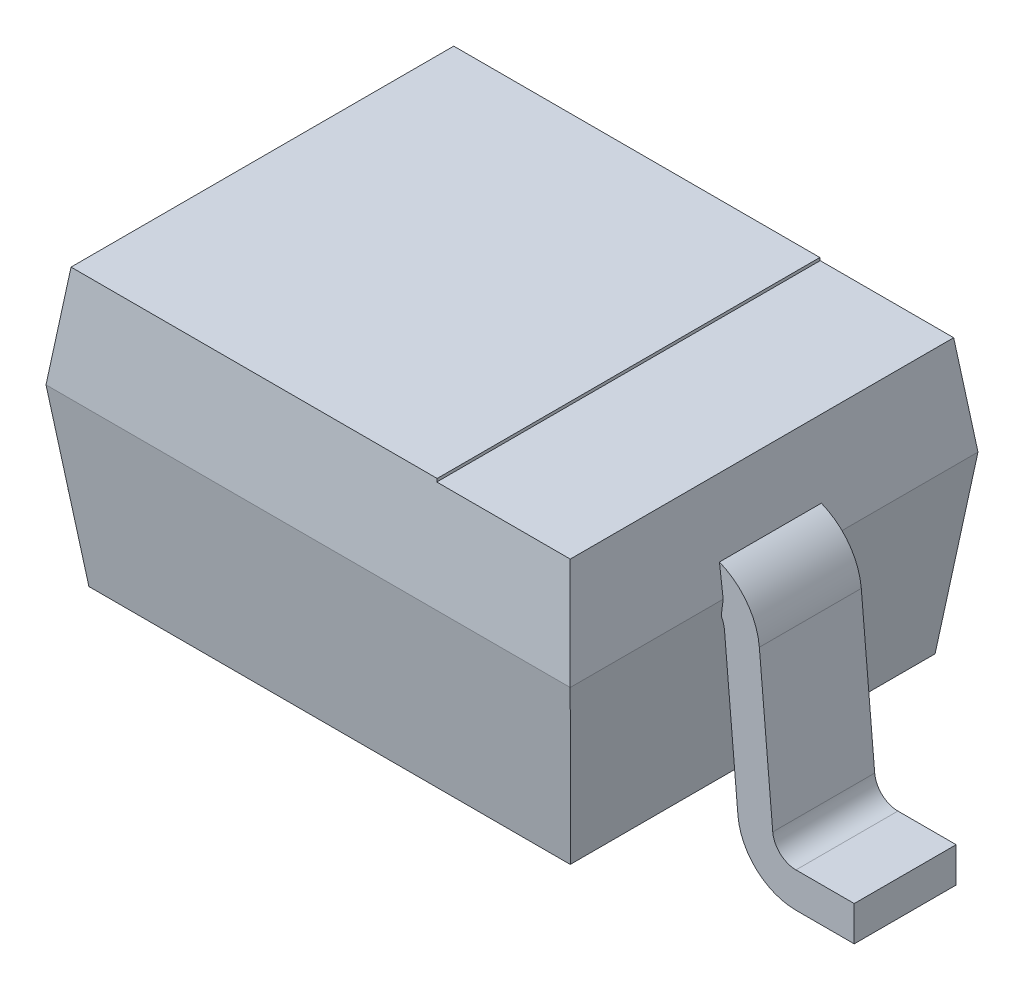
ISO-10303-21;
HEADER;
FILE_DESCRIPTION(('STEP AP214'),'2;1');
FILE_NAME('part.step','',(''),(''),'','','');
FILE_SCHEMA(('AUTOMOTIVE_DESIGN { 1 0 10303 214 1 1 1 1 }'));
ENDSEC;
DATA;
#1=APPLICATION_CONTEXT('core data for automotive mechanical design processes');
#2=APPLICATION_PROTOCOL_DEFINITION('international standard','automotive_design',2000,#1);
#3=PRODUCT_CONTEXT('',#1,'mechanical');
#4=PRODUCT('Part','Part','',(#3));
#5=PRODUCT_RELATED_PRODUCT_CATEGORY('part','',(#4));
#6=PRODUCT_DEFINITION_FORMATION('','',#4);
#7=PRODUCT_DEFINITION_CONTEXT('part definition',#1,'design');
#8=PRODUCT_DEFINITION('design','',#6,#7);
#9=PRODUCT_DEFINITION_SHAPE('','',#8);
#10=(LENGTH_UNIT() NAMED_UNIT(*) SI_UNIT(.MILLI.,.METRE.));
#11=(NAMED_UNIT(*) PLANE_ANGLE_UNIT() SI_UNIT($,.RADIAN.));
#12=(NAMED_UNIT(*) SI_UNIT($,.STERADIAN.) SOLID_ANGLE_UNIT());
#13=UNCERTAINTY_MEASURE_WITH_UNIT(LENGTH_MEASURE(1.E-05),#10,'distance_accuracy_value','');
#14=(GEOMETRIC_REPRESENTATION_CONTEXT(3) GLOBAL_UNCERTAINTY_ASSIGNED_CONTEXT((#13)) GLOBAL_UNIT_ASSIGNED_CONTEXT((#10,
#11,#12)) REPRESENTATION_CONTEXT('',''));
#15=CARTESIAN_POINT('',(0.,0.,0.));
#16=DIRECTION('',(0.,0.,1.));
#17=DIRECTION('',(1.,0.,0.));
#18=AXIS2_PLACEMENT_3D('',#15,#16,#17);
#19=CARTESIAN_POINT('',(0.9,0.8,0.7));
#20=DIRECTION('',(0.992546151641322,-0.121869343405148,0.));
#21=DIRECTION('',(0.121869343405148,0.992546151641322,0.));
#22=AXIS2_PLACEMENT_3D('',#19,#20,#21);
#23=PLANE('',#22);
#24=DIRECTION('',(-0.121869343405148,-0.992546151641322,0.));
#25=VECTOR('',#24,1.);
#26=CARTESIAN_POINT('',(0.9,0.8,0.175));
#27=LINE('',#26,#25);
#28=CARTESIAN_POINT('',(0.9,0.8,0.175));
#29=VERTEX_POINT('',#28);
#30=CARTESIAN_POINT('',(0.893470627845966,0.746822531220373,0.175));
#31=VERTEX_POINT('',#30);
#32=EDGE_CURVE('E416',#29,#31,#27,.T.);
#33=ORIENTED_EDGE('',*,*,#32,.F.);
#34=DIRECTION('',(0.,0.,-1.));
#35=VECTOR('',#34,1.);
#36=CARTESIAN_POINT('',(0.9,0.8,0.7));
#37=LINE('',#36,#35);
#38=CARTESIAN_POINT('',(0.9,0.8,0.7));
#39=VERTEX_POINT('',#38);
#40=EDGE_CURVE('E253',#39,#29,#37,.T.);
#41=ORIENTED_EDGE('',*,*,#40,.F.);
#42=DIRECTION('',(0.120974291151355,0.985256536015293,0.120974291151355));
#43=VECTOR('',#42,1.);
#44=CARTESIAN_POINT('',(0.873657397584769,0.58545672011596,0.673657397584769));
#45=LINE('',#44,#43);
#46=CARTESIAN_POINT('',(0.826329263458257,0.2,0.626329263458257));
#47=VERTEX_POINT('',#46);
#48=EDGE_CURVE('E267',#47,#39,#45,.T.);
#49=ORIENTED_EDGE('',*,*,#48,.F.);
#50=DIRECTION('',(0.,0.,-1.));
#51=VECTOR('',#50,1.);
#52=CARTESIAN_POINT('',(0.826329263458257,0.2,0.7));
#53=LINE('',#52,#51);
#54=CARTESIAN_POINT('',(0.826329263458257,0.2,-0.626329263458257));
#55=VERTEX_POINT('',#54);
#56=EDGE_CURVE('E266',#47,#55,#53,.T.);
#57=ORIENTED_EDGE('',*,*,#56,.T.);
#58=DIRECTION('',(0.120974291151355,0.985256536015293,-0.120974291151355));
#59=VECTOR('',#58,1.);
#60=CARTESIAN_POINT('',(0.879511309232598,0.633133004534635,-0.679511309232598));
#61=LINE('',#60,#59);
#62=CARTESIAN_POINT('',(0.9,0.8,-0.7));
#63=VERTEX_POINT('',#62);
#64=EDGE_CURVE('E272',#55,#63,#61,.T.);
#65=ORIENTED_EDGE('',*,*,#64,.T.);
#66=CARTESIAN_POINT('',(0.9,0.8,-0.175));
#67=VERTEX_POINT('',#66);
#68=EDGE_CURVE('E257',#67,#63,#37,.T.);
#69=ORIENTED_EDGE('',*,*,#68,.F.);
#70=DIRECTION('',(-0.121869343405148,-0.992546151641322,0.));
#71=VECTOR('',#70,1.);
#72=CARTESIAN_POINT('',(0.9,0.8,-0.175));
#73=LINE('',#72,#71);
#74=CARTESIAN_POINT('',(0.893470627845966,0.746822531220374,-0.175));
#75=VERTEX_POINT('',#74);
#76=EDGE_CURVE('E411',#67,#75,#73,.T.);
#77=ORIENTED_EDGE('',*,*,#76,.T.);
#78=DIRECTION('',(0.,0.,-1.));
#79=VECTOR('',#78,1.);
#80=CARTESIAN_POINT('',(0.893470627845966,0.746822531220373,0.175));
#81=LINE('',#80,#79);
#82=EDGE_CURVE('E54',#75,#31,#81,.F.);
#83=ORIENTED_EDGE('',*,*,#82,.T.);
#84=EDGE_LOOP('',(#33,#41,#49,#57,#65,#69,#77,#83));
#85=FACE_BOUND('',#84,.T.);
#86=ADVANCED_FACE('F31',(#85),#23,.T.);
#87=CARTESIAN_POINT('',(-0.9,0.8,0.7));
#88=DIRECTION('',(0.,-0.121869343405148,0.992546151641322));
#89=DIRECTION('',(0.,-0.992546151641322,-0.121869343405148));
#90=AXIS2_PLACEMENT_3D('',#87,#88,#89);
#91=PLANE('',#90);
#92=DIRECTION('',(1.,0.,0.));
#93=VECTOR('',#92,1.);
#94=CARTESIAN_POINT('',(-0.9,0.8,0.7));
#95=LINE('',#94,#93);
#96=CARTESIAN_POINT('',(-0.9,0.8,0.7));
#97=VERTEX_POINT('',#96);
#98=EDGE_CURVE('E263',#97,#39,#95,.T.);
#99=ORIENTED_EDGE('',*,*,#98,.F.);
#100=DIRECTION('',(-0.120974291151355,0.985256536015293,0.120974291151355));
#101=VECTOR('',#100,1.);
#102=CARTESIAN_POINT('',(-0.9,0.8,0.7));
#103=LINE('',#102,#101);
#104=CARTESIAN_POINT('',(-0.826329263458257,0.2,0.626329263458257));
#105=VERTEX_POINT('',#104);
#106=EDGE_CURVE('E271',#105,#97,#103,.T.);
#107=ORIENTED_EDGE('',*,*,#106,.F.);
#108=DIRECTION('',(1.,0.,0.));
#109=VECTOR('',#108,1.);
#110=CARTESIAN_POINT('',(-0.9,0.2,0.626329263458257));
#111=LINE('',#110,#109);
#112=EDGE_CURVE('E276',#105,#47,#111,.T.);
#113=ORIENTED_EDGE('',*,*,#112,.T.);
#114=ORIENTED_EDGE('',*,*,#48,.T.);
#115=EDGE_LOOP('',(#99,#107,#113,#114));
#116=FACE_BOUND('',#115,.T.);
#117=ADVANCED_FACE('F33',(#116),#91,.T.);
#118=CARTESIAN_POINT('',(-0.9,0.8,0.7));
#119=DIRECTION('',(-0.992546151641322,-0.121869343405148,0.));
#120=DIRECTION('',(0.121869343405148,-0.992546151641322,0.));
#121=AXIS2_PLACEMENT_3D('',#118,#119,#120);
#122=PLANE('',#121);
#123=DIRECTION('',(-0.121869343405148,0.992546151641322,0.));
#124=VECTOR('',#123,1.);
#125=CARTESIAN_POINT('',(-0.9,0.8,0.175));
#126=LINE('',#125,#124);
#127=CARTESIAN_POINT('',(-0.893470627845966,0.746822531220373,0.175));
#128=VERTEX_POINT('',#127);
#129=CARTESIAN_POINT('',(-0.9,0.8,0.175));
#130=VERTEX_POINT('',#129);
#131=EDGE_CURVE('E311',#128,#130,#126,.T.);
#132=ORIENTED_EDGE('',*,*,#131,.F.);
#133=DIRECTION('',(0.,0.,-1.));
#134=VECTOR('',#133,1.);
#135=CARTESIAN_POINT('',(-0.893470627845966,0.746822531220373,0.175));
#136=LINE('',#135,#134);
#137=CARTESIAN_POINT('',(-0.893470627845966,0.746822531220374,-0.175));
#138=VERTEX_POINT('',#137);
#139=EDGE_CURVE('E300',#128,#138,#136,.T.);
#140=ORIENTED_EDGE('',*,*,#139,.T.);
#141=DIRECTION('',(-0.121869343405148,0.992546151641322,0.));
#142=VECTOR('',#141,1.);
#143=CARTESIAN_POINT('',(-0.9,0.8,-0.175));
#144=LINE('',#143,#142);
#145=CARTESIAN_POINT('',(-0.9,0.8,-0.175));
#146=VERTEX_POINT('',#145);
#147=EDGE_CURVE('E308',#138,#146,#144,.T.);
#148=ORIENTED_EDGE('',*,*,#147,.T.);
#149=DIRECTION('',(0.,0.,1.));
#150=VECTOR('',#149,1.);
#151=CARTESIAN_POINT('',(-0.9,0.8,0.7));
#152=LINE('',#151,#150);
#153=CARTESIAN_POINT('',(-0.9,0.8,-0.7));
#154=VERTEX_POINT('',#153);
#155=EDGE_CURVE('E261',#154,#146,#152,.T.);
#156=ORIENTED_EDGE('',*,*,#155,.F.);
#157=DIRECTION('',(-0.120974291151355,0.985256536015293,-0.120974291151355));
#158=VECTOR('',#157,1.);
#159=CARTESIAN_POINT('',(-0.9,0.8,-0.7));
#160=LINE('',#159,#158);
#161=CARTESIAN_POINT('',(-0.826329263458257,0.2,-0.626329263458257));
#162=VERTEX_POINT('',#161);
#163=EDGE_CURVE('E275',#162,#154,#160,.T.);
#164=ORIENTED_EDGE('',*,*,#163,.F.);
#165=DIRECTION('',(0.,0.,1.));
#166=VECTOR('',#165,1.);
#167=CARTESIAN_POINT('',(-0.826329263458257,0.2,0.7));
#168=LINE('',#167,#166);
#169=EDGE_CURVE('E285',#162,#105,#168,.T.);
#170=ORIENTED_EDGE('',*,*,#169,.T.);
#171=ORIENTED_EDGE('',*,*,#106,.T.);
#172=EDGE_CURVE('E260',#130,#97,#152,.T.);
#173=ORIENTED_EDGE('',*,*,#172,.F.);
#174=EDGE_LOOP('',(#132,#140,#148,#156,#164,#170,#171,#173));
#175=FACE_BOUND('',#174,.T.);
#176=ADVANCED_FACE('F306',(#175),#122,.T.);
#177=CARTESIAN_POINT('',(-0.9,0.8,-0.7));
#178=DIRECTION('',(0.,-0.121869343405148,-0.992546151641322));
#179=DIRECTION('',(0.,0.992546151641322,-0.121869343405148));
#180=AXIS2_PLACEMENT_3D('',#177,#178,#179);
#181=PLANE('',#180);
#182=DIRECTION('',(-1.,0.,0.));
#183=VECTOR('',#182,1.);
#184=CARTESIAN_POINT('',(-0.9,0.8,-0.7));
#185=LINE('',#184,#183);
#186=EDGE_CURVE('E256',#63,#154,#185,.T.);
#187=ORIENTED_EDGE('',*,*,#186,.F.);
#188=ORIENTED_EDGE('',*,*,#64,.F.);
#189=DIRECTION('',(-1.,0.,0.));
#190=VECTOR('',#189,1.);
#191=CARTESIAN_POINT('',(-0.9,0.2,-0.626329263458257));
#192=LINE('',#191,#190);
#193=EDGE_CURVE('E282',#55,#162,#192,.T.);
#194=ORIENTED_EDGE('',*,*,#193,.T.);
#195=ORIENTED_EDGE('',*,*,#163,.T.);
#196=EDGE_LOOP('',(#187,#188,#194,#195));
#197=FACE_BOUND('',#196,.T.);
#198=ADVANCED_FACE('F439',(#197),#181,.T.);
#199=CARTESIAN_POINT('',(0.9,0.2,-0.7));
#200=DIRECTION('',(0.,-1.,0.));
#201=DIRECTION('',(0.,0.,-1.));
#202=AXIS2_PLACEMENT_3D('',#199,#200,#201);
#203=PLANE('',#202);
#204=ORIENTED_EDGE('',*,*,#56,.F.);
#205=ORIENTED_EDGE('',*,*,#112,.F.);
#206=ORIENTED_EDGE('',*,*,#169,.F.);
#207=ORIENTED_EDGE('',*,*,#193,.F.);
#208=EDGE_LOOP('',(#204,#205,#206,#207));
#209=FACE_BOUND('',#208,.T.);
#210=ADVANCED_FACE('F436',(#209),#203,.T.);
#211=CARTESIAN_POINT('',(0.9,0.8,0.7));
#212=DIRECTION('',(0.992546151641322,0.121869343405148,0.));
#213=DIRECTION('',(-0.121869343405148,0.992546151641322,0.));
#214=AXIS2_PLACEMENT_3D('',#211,#212,#213);
#215=PLANE('',#214);
#216=DIRECTION('',(0.120974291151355,-0.985256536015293,-0.120974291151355));
#217=VECTOR('',#216,1.);
#218=CARTESIAN_POINT('',(0.873657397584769,1.01454327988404,-0.673657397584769));
#219=LINE('',#218,#217);
#220=CARTESIAN_POINT('',(0.858253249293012,1.14,-0.658253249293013));
#221=VERTEX_POINT('',#220);
#222=EDGE_CURVE('E418',#221,#63,#219,.T.);
#223=ORIENTED_EDGE('',*,*,#222,.F.);
#224=DIRECTION('',(0.,0.,-1.));
#225=VECTOR('',#224,1.);
#226=CARTESIAN_POINT('',(0.858253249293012,1.14,0.7));
#227=LINE('',#226,#225);
#228=CARTESIAN_POINT('',(0.858253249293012,1.14,0.658253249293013));
#229=VERTEX_POINT('',#228);
#230=EDGE_CURVE('E516',#221,#229,#227,.F.);
#231=ORIENTED_EDGE('',*,*,#230,.T.);
#232=DIRECTION('',(0.120974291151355,-0.985256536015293,0.120974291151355));
#233=VECTOR('',#232,1.);
#234=CARTESIAN_POINT('',(0.9,0.8,0.7));
#235=LINE('',#234,#233);
#236=EDGE_CURVE('E245',#229,#39,#235,.T.);
#237=ORIENTED_EDGE('',*,*,#236,.T.);
#238=ORIENTED_EDGE('',*,*,#40,.T.);
#239=DIRECTION('',(0.121869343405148,-0.992546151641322,0.));
#240=VECTOR('',#239,1.);
#241=CARTESIAN_POINT('',(0.9,0.8,0.175));
#242=LINE('',#241,#240);
#243=CARTESIAN_POINT('',(0.887217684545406,0.904103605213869,0.175));
#244=VERTEX_POINT('',#243);
#245=EDGE_CURVE('E414',#29,#244,#242,.F.);
#246=ORIENTED_EDGE('',*,*,#245,.T.);
#247=DIRECTION('',(0.,0.,-1.));
#248=VECTOR('',#247,1.);
#249=CARTESIAN_POINT('',(0.887217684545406,0.904103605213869,0.175));
#250=LINE('',#249,#248);
#251=CARTESIAN_POINT('',(0.887217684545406,0.904103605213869,-0.175));
#252=VERTEX_POINT('',#251);
#253=EDGE_CURVE('E297',#252,#244,#250,.F.);
#254=ORIENTED_EDGE('',*,*,#253,.F.);
#255=DIRECTION('',(0.121869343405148,-0.992546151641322,0.));
#256=VECTOR('',#255,1.);
#257=CARTESIAN_POINT('',(0.9,0.8,-0.175));
#258=LINE('',#257,#256);
#259=EDGE_CURVE('E322',#67,#252,#258,.F.);
#260=ORIENTED_EDGE('',*,*,#259,.F.);
#261=ORIENTED_EDGE('',*,*,#68,.T.);
#262=EDGE_LOOP('',(#223,#231,#237,#238,#246,#254,#260,#261));
#263=FACE_BOUND('',#262,.T.);
#264=ADVANCED_FACE('F522',(#263),#215,.T.);
#265=CARTESIAN_POINT('',(-0.9,0.8,-0.7));
#266=DIRECTION('',(0.,0.121869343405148,-0.992546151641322));
#267=DIRECTION('',(0.,0.992546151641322,0.121869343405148));
#268=AXIS2_PLACEMENT_3D('',#265,#266,#267);
#269=PLANE('',#268);
#270=DIRECTION('',(1.,0.,0.));
#271=VECTOR('',#270,1.);
#272=CARTESIAN_POINT('',(0.9,1.15,-0.657025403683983));
#273=LINE('',#272,#271);
#274=CARTESIAN_POINT('',(0.4,1.15,-0.657025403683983));
#275=VERTEX_POINT('',#274);
#276=CARTESIAN_POINT('',(-0.857025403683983,1.15,-0.657025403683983));
#277=VERTEX_POINT('',#276);
#278=EDGE_CURVE('E249',#275,#277,#273,.F.);
#279=ORIENTED_EDGE('',*,*,#278,.F.);
#280=DIRECTION('',(0.,0.992546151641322,0.121869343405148));
#281=VECTOR('',#280,1.);
#282=CARTESIAN_POINT('',(0.4,0.8,-0.7));
#283=LINE('',#282,#281);
#284=CARTESIAN_POINT('',(0.4,1.14,-0.658253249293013));
#285=VERTEX_POINT('',#284);
#286=EDGE_CURVE('E46',#275,#285,#283,.F.);
#287=ORIENTED_EDGE('',*,*,#286,.T.);
#288=DIRECTION('',(-1.,0.,0.));
#289=VECTOR('',#288,1.);
#290=CARTESIAN_POINT('',(-0.9,1.14,-0.658253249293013));
#291=LINE('',#290,#289);
#292=EDGE_CURVE('E494',#285,#221,#291,.F.);
#293=ORIENTED_EDGE('',*,*,#292,.T.);
#294=ORIENTED_EDGE('',*,*,#222,.T.);
#295=ORIENTED_EDGE('',*,*,#186,.T.);
#296=DIRECTION('',(-0.120974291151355,-0.985256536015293,-0.120974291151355));
#297=VECTOR('',#296,1.);
#298=CARTESIAN_POINT('',(-0.879511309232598,0.966866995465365,-0.679511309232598));
#299=LINE('',#298,#297);
#300=EDGE_CURVE('E419',#277,#154,#299,.T.);
#301=ORIENTED_EDGE('',*,*,#300,.F.);
#302=EDGE_LOOP('',(#279,#287,#293,#294,#295,#301));
#303=FACE_BOUND('',#302,.T.);
#304=ADVANCED_FACE('F425',(#303),#269,.T.);
#305=CARTESIAN_POINT('',(-0.9,0.8,0.7));
#306=DIRECTION('',(-0.992546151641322,0.121869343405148,0.));
#307=DIRECTION('',(-0.121869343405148,-0.992546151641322,0.));
#308=AXIS2_PLACEMENT_3D('',#305,#306,#307);
#309=PLANE('',#308);
#310=DIRECTION('',(0.,0.,-1.));
#311=VECTOR('',#310,1.);
#312=CARTESIAN_POINT('',(-0.887217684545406,0.904103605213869,0.175));
#313=LINE('',#312,#311);
#314=CARTESIAN_POINT('',(-0.887217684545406,0.904103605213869,0.175));
#315=VERTEX_POINT('',#314);
#316=CARTESIAN_POINT('',(-0.887217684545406,0.904103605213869,-0.175));
#317=VERTEX_POINT('',#316);
#318=EDGE_CURVE('E292',#315,#317,#313,.T.);
#319=ORIENTED_EDGE('',*,*,#318,.F.);
#320=DIRECTION('',(0.121869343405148,0.992546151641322,0.));
#321=VECTOR('',#320,1.);
#322=CARTESIAN_POINT('',(-0.9,0.8,0.175));
#323=LINE('',#322,#321);
#324=EDGE_CURVE('E295',#315,#130,#323,.F.);
#325=ORIENTED_EDGE('',*,*,#324,.T.);
#326=ORIENTED_EDGE('',*,*,#172,.T.);
#327=DIRECTION('',(-0.120974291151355,-0.985256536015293,0.120974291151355));
#328=VECTOR('',#327,1.);
#329=CARTESIAN_POINT('',(-0.9,0.8,0.7));
#330=LINE('',#329,#328);
#331=CARTESIAN_POINT('',(-0.857025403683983,1.15,0.657025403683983));
#332=VERTEX_POINT('',#331);
#333=EDGE_CURVE('E247',#332,#97,#330,.T.);
#334=ORIENTED_EDGE('',*,*,#333,.F.);
#335=DIRECTION('',(0.,0.,-1.));
#336=VECTOR('',#335,1.);
#337=CARTESIAN_POINT('',(-0.857025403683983,1.15,-0.7));
#338=LINE('',#337,#336);
#339=EDGE_CURVE('E243',#277,#332,#338,.F.);
#340=ORIENTED_EDGE('',*,*,#339,.F.);
#341=ORIENTED_EDGE('',*,*,#300,.T.);
#342=ORIENTED_EDGE('',*,*,#155,.T.);
#343=DIRECTION('',(0.121869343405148,0.992546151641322,0.));
#344=VECTOR('',#343,1.);
#345=CARTESIAN_POINT('',(-0.9,0.8,-0.175));
#346=LINE('',#345,#344);
#347=EDGE_CURVE('E270',#317,#146,#346,.F.);
#348=ORIENTED_EDGE('',*,*,#347,.F.);
#349=EDGE_LOOP('',(#319,#325,#326,#334,#340,#341,#342,#348));
#350=FACE_BOUND('',#349,.T.);
#351=ADVANCED_FACE('F428',(#350),#309,.T.);
#352=CARTESIAN_POINT('',(-0.9,0.8,0.7));
#353=DIRECTION('',(0.,0.121869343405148,0.992546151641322));
#354=DIRECTION('',(0.,-0.992546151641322,0.121869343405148));
#355=AXIS2_PLACEMENT_3D('',#352,#353,#354);
#356=PLANE('',#355);
#357=DIRECTION('',(1.,0.,0.));
#358=VECTOR('',#357,1.);
#359=CARTESIAN_POINT('',(-0.9,1.14,0.658253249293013));
#360=LINE('',#359,#358);
#361=CARTESIAN_POINT('',(0.4,1.14,0.658253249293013));
#362=VERTEX_POINT('',#361);
#363=EDGE_CURVE('E11',#229,#362,#360,.F.);
#364=ORIENTED_EDGE('',*,*,#363,.T.);
#365=DIRECTION('',(0.,-0.992546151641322,0.121869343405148));
#366=VECTOR('',#365,1.);
#367=CARTESIAN_POINT('',(0.4,0.8,0.7));
#368=LINE('',#367,#366);
#369=CARTESIAN_POINT('',(0.4,1.15,0.657025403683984));
#370=VERTEX_POINT('',#369);
#371=EDGE_CURVE('E228',#362,#370,#368,.F.);
#372=ORIENTED_EDGE('',*,*,#371,.T.);
#373=DIRECTION('',(-1.,0.,0.));
#374=VECTOR('',#373,1.);
#375=CARTESIAN_POINT('',(0.9,1.15,0.657025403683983));
#376=LINE('',#375,#374);
#377=EDGE_CURVE('E237',#332,#370,#376,.F.);
#378=ORIENTED_EDGE('',*,*,#377,.F.);
#379=ORIENTED_EDGE('',*,*,#333,.T.);
#380=ORIENTED_EDGE('',*,*,#98,.T.);
#381=ORIENTED_EDGE('',*,*,#236,.F.);
#382=EDGE_LOOP('',(#364,#372,#378,#379,#380,#381));
#383=FACE_BOUND('',#382,.T.);
#384=ADVANCED_FACE('F235',(#383),#356,.T.);
#385=CARTESIAN_POINT('',(0.9,1.15,-0.7));
#386=DIRECTION('',(0.,-1.,0.));
#387=DIRECTION('',(0.,0.,-1.));
#388=AXIS2_PLACEMENT_3D('',#385,#386,#387);
#389=PLANE('',#388);
#390=ORIENTED_EDGE('',*,*,#377,.T.);
#391=DIRECTION('',(0.,0.,-1.));
#392=VECTOR('',#391,1.);
#393=CARTESIAN_POINT('',(0.4,1.15,-0.7));
#394=LINE('',#393,#392);
#395=EDGE_CURVE('E39',#370,#275,#394,.T.);
#396=ORIENTED_EDGE('',*,*,#395,.T.);
#397=ORIENTED_EDGE('',*,*,#278,.T.);
#398=ORIENTED_EDGE('',*,*,#339,.T.);
#399=EDGE_LOOP('',(#390,#396,#397,#398));
#400=FACE_BOUND('',#399,.T.);
#401=ADVANCED_FACE('F241',(#400),#389,.F.);
#402=CARTESIAN_POINT('',(-1.07030442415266,0.193027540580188,0.175));
#403=DIRECTION('',(0.996194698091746,-0.0871557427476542,0.));
#404=DIRECTION('',(0.0871557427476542,0.996194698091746,0.));
#405=AXIS2_PLACEMENT_3D('',#402,#403,#404);
#406=PLANE('',#405);
#407=DIRECTION('',(-0.0871557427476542,-0.996194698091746,0.));
#408=VECTOR('',#407,1.);
#409=CARTESIAN_POINT('',(-1.07030442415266,0.193027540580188,-0.175));
#410=LINE('',#409,#408);
#411=CARTESIAN_POINT('',(-1.02427255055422,0.719174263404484,-0.175));
#412=VERTEX_POINT('',#411);
#413=CARTESIAN_POINT('',(-1.07030442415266,0.193027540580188,-0.175));
#414=VERTEX_POINT('',#413);
#415=EDGE_CURVE('E356',#412,#414,#410,.T.);
#416=ORIENTED_EDGE('',*,*,#415,.T.);
#417=DIRECTION('',(0.,0.,-1.));
#418=VECTOR('',#417,1.);
#419=CARTESIAN_POINT('',(-1.07030442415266,0.193027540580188,0.175));
#420=LINE('',#419,#418);
#421=CARTESIAN_POINT('',(-1.07030442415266,0.193027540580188,0.175));
#422=VERTEX_POINT('',#421);
#423=EDGE_CURVE('E370',#422,#414,#420,.T.);
#424=ORIENTED_EDGE('',*,*,#423,.F.);
#425=DIRECTION('',(-0.0871557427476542,-0.996194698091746,0.));
#426=VECTOR('',#425,1.);
#427=CARTESIAN_POINT('',(-1.07030442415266,0.193027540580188,0.175));
#428=LINE('',#427,#426);
#429=CARTESIAN_POINT('',(-1.02427255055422,0.719174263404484,0.175));
#430=VERTEX_POINT('',#429);
#431=EDGE_CURVE('E485',#430,#422,#428,.T.);
#432=ORIENTED_EDGE('',*,*,#431,.F.);
#433=DIRECTION('',(0.,0.,-1.));
#434=VECTOR('',#433,1.);
#435=CARTESIAN_POINT('',(-1.02427255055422,0.719174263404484,0.175));
#436=LINE('',#435,#434);
#437=EDGE_CURVE('E373',#430,#412,#436,.T.);
#438=ORIENTED_EDGE('',*,*,#437,.T.);
#439=EDGE_LOOP('',(#416,#424,#432,#438));
#440=FACE_BOUND('',#439,.T.);
#441=ADVANCED_FACE('F618',(#440),#406,.F.);
#442=CARTESIAN_POINT('',(-1.15,0.2,0.175));
#443=DIRECTION('',(0.,0.,-1.));
#444=DIRECTION('',(-1.,0.,0.));
#445=AXIS2_PLACEMENT_3D('',#442,#443,#444);
#446=CYLINDRICAL_SURFACE('',#445,0.08);
#447=CARTESIAN_POINT('',(-1.15,0.2,-0.175));
#448=DIRECTION('',(0.,0.,-1.));
#449=DIRECTION('',(1.,0.,0.));
#450=AXIS2_PLACEMENT_3D('',#447,#448,#449);
#451=CIRCLE('',#450,0.08);
#452=CARTESIAN_POINT('',(-1.15,0.12,-0.175));
#453=VERTEX_POINT('',#452);
#454=EDGE_CURVE('E358',#414,#453,#451,.T.);
#455=ORIENTED_EDGE('',*,*,#454,.T.);
#456=DIRECTION('',(0.,0.,-1.));
#457=VECTOR('',#456,1.);
#458=CARTESIAN_POINT('',(-1.15,0.12,0.175));
#459=LINE('',#458,#457);
#460=CARTESIAN_POINT('',(-1.15,0.12,0.175));
#461=VERTEX_POINT('',#460);
#462=EDGE_CURVE('E366',#461,#453,#459,.T.);
#463=ORIENTED_EDGE('',*,*,#462,.F.);
#464=CARTESIAN_POINT('',(-1.15,0.2,0.175));
#465=DIRECTION('',(0.,0.,-1.));
#466=DIRECTION('',(1.,0.,0.));
#467=AXIS2_PLACEMENT_3D('',#464,#465,#466);
#468=CIRCLE('',#467,0.08);
#469=EDGE_CURVE('E487',#422,#461,#468,.T.);
#470=ORIENTED_EDGE('',*,*,#469,.F.);
#471=ORIENTED_EDGE('',*,*,#423,.T.);
#472=EDGE_LOOP('',(#455,#463,#470,#471));
#473=FACE_BOUND('',#472,.T.);
#474=ADVANCED_FACE('F625',(#473),#446,.F.);
#475=CARTESIAN_POINT('',(-1.35,0.12,0.175));
#476=DIRECTION('',(0.,-1.,0.));
#477=DIRECTION('',(0.,0.,-1.));
#478=AXIS2_PLACEMENT_3D('',#475,#476,#477);
#479=PLANE('',#478);
#480=DIRECTION('',(-1.,0.,0.));
#481=VECTOR('',#480,1.);
#482=CARTESIAN_POINT('',(-1.35,0.12,-0.175));
#483=LINE('',#482,#481);
#484=CARTESIAN_POINT('',(-1.35,0.12,-0.175));
#485=VERTEX_POINT('',#484);
#486=EDGE_CURVE('E360',#453,#485,#483,.T.);
#487=ORIENTED_EDGE('',*,*,#486,.T.);
#488=DIRECTION('',(0.,0.,-1.));
#489=VECTOR('',#488,1.);
#490=CARTESIAN_POINT('',(-1.35,0.12,0.175));
#491=LINE('',#490,#489);
#492=CARTESIAN_POINT('',(-1.35,0.12,0.175));
#493=VERTEX_POINT('',#492);
#494=EDGE_CURVE('E363',#493,#485,#491,.T.);
#495=ORIENTED_EDGE('',*,*,#494,.F.);
#496=DIRECTION('',(-1.,0.,0.));
#497=VECTOR('',#496,1.);
#498=CARTESIAN_POINT('',(-1.35,0.12,0.175));
#499=LINE('',#498,#497);
#500=EDGE_CURVE('E367',#461,#493,#499,.T.);
#501=ORIENTED_EDGE('',*,*,#500,.F.);
#502=ORIENTED_EDGE('',*,*,#462,.T.);
#503=EDGE_LOOP('',(#487,#495,#501,#502));
#504=FACE_BOUND('',#503,.T.);
#505=ADVANCED_FACE('F633',(#504),#479,.F.);
#506=CARTESIAN_POINT('',(-1.35,0.,0.175));
#507=DIRECTION('',(1.,0.,0.));
#508=DIRECTION('',(0.,0.,-1.));
#509=AXIS2_PLACEMENT_3D('',#506,#507,#508);
#510=PLANE('',#509);
#511=DIRECTION('',(0.,-1.,0.));
#512=VECTOR('',#511,1.);
#513=CARTESIAN_POINT('',(-1.35,0.,-0.175));
#514=LINE('',#513,#512);
#515=CARTESIAN_POINT('',(-1.35,0.,-0.175));
#516=VERTEX_POINT('',#515);
#517=EDGE_CURVE('E490',#485,#516,#514,.T.);
#518=ORIENTED_EDGE('',*,*,#517,.T.);
#519=DIRECTION('',(0.,0.,-1.));
#520=VECTOR('',#519,1.);
#521=CARTESIAN_POINT('',(-1.35,0.,0.175));
#522=LINE('',#521,#520);
#523=CARTESIAN_POINT('',(-1.35,0.,0.175));
#524=VERTEX_POINT('',#523);
#525=EDGE_CURVE('E323',#524,#516,#522,.T.);
#526=ORIENTED_EDGE('',*,*,#525,.F.);
#527=DIRECTION('',(0.,-1.,0.));
#528=VECTOR('',#527,1.);
#529=CARTESIAN_POINT('',(-1.35,0.,0.175));
#530=LINE('',#529,#528);
#531=EDGE_CURVE('E362',#493,#524,#530,.T.);
#532=ORIENTED_EDGE('',*,*,#531,.F.);
#533=ORIENTED_EDGE('',*,*,#494,.T.);
#534=EDGE_LOOP('',(#518,#526,#532,#533));
#535=FACE_BOUND('',#534,.T.);
#536=ADVANCED_FACE('F641',(#535),#510,.F.);
#537=CARTESIAN_POINT('',(-1.35,0.,0.175));
#538=DIRECTION('',(0.,1.,0.));
#539=DIRECTION('',(0.,0.,1.));
#540=AXIS2_PLACEMENT_3D('',#537,#538,#539);
#541=PLANE('',#540);
#542=DIRECTION('',(1.,0.,0.));
#543=VECTOR('',#542,1.);
#544=CARTESIAN_POINT('',(-1.35,0.,-0.175));
#545=LINE('',#544,#543);
#546=CARTESIAN_POINT('',(-1.15,0.,-0.175));
#547=VERTEX_POINT('',#546);
#548=EDGE_CURVE('E493',#516,#547,#545,.T.);
#549=ORIENTED_EDGE('',*,*,#548,.T.);
#550=DIRECTION('',(0.,0.,-1.));
#551=VECTOR('',#550,1.);
#552=CARTESIAN_POINT('',(-1.15,0.,0.175));
#553=LINE('',#552,#551);
#554=CARTESIAN_POINT('',(-1.15,0.,0.175));
#555=VERTEX_POINT('',#554);
#556=EDGE_CURVE('E404',#555,#547,#553,.T.);
#557=ORIENTED_EDGE('',*,*,#556,.F.);
#558=DIRECTION('',(1.,0.,0.));
#559=VECTOR('',#558,1.);
#560=CARTESIAN_POINT('',(-1.35,0.,0.175));
#561=LINE('',#560,#559);
#562=EDGE_CURVE('E508',#524,#555,#561,.T.);
#563=ORIENTED_EDGE('',*,*,#562,.F.);
#564=ORIENTED_EDGE('',*,*,#525,.T.);
#565=EDGE_LOOP('',(#549,#557,#563,#564));
#566=FACE_BOUND('',#565,.T.);
#567=ADVANCED_FACE('F649',(#566),#541,.F.);
#568=CARTESIAN_POINT('',(-1.15,0.2,0.175));
#569=DIRECTION('',(0.,0.,-1.));
#570=DIRECTION('',(-1.,0.,0.));
#571=AXIS2_PLACEMENT_3D('',#568,#569,#570);
#572=CYLINDRICAL_SURFACE('',#571,0.2);
#573=CARTESIAN_POINT('',(-1.15,0.2,-0.175));
#574=DIRECTION('',(0.,0.,1.));
#575=DIRECTION('',(1.,0.,0.));
#576=AXIS2_PLACEMENT_3D('',#573,#574,#575);
#577=CIRCLE('',#576,0.2);
#578=CARTESIAN_POINT('',(-0.950761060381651,0.182568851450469,-0.175));
#579=VERTEX_POINT('',#578);
#580=EDGE_CURVE('E334',#547,#579,#577,.T.);
#581=ORIENTED_EDGE('',*,*,#580,.T.);
#582=DIRECTION('',(0.,0.,-1.));
#583=VECTOR('',#582,1.);
#584=CARTESIAN_POINT('',(-0.950761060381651,0.182568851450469,0.175));
#585=LINE('',#584,#583);
#586=CARTESIAN_POINT('',(-0.950761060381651,0.182568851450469,0.175));
#587=VERTEX_POINT('',#586);
#588=EDGE_CURVE('E401',#587,#579,#585,.T.);
#589=ORIENTED_EDGE('',*,*,#588,.F.);
#590=CARTESIAN_POINT('',(-1.15,0.2,0.175));
#591=DIRECTION('',(0.,0.,1.));
#592=DIRECTION('',(1.,0.,0.));
#593=AXIS2_PLACEMENT_3D('',#590,#591,#592);
#594=CIRCLE('',#593,0.2);
#595=EDGE_CURVE('E506',#555,#587,#594,.T.);
#596=ORIENTED_EDGE('',*,*,#595,.F.);
#597=ORIENTED_EDGE('',*,*,#556,.T.);
#598=EDGE_LOOP('',(#581,#589,#596,#597));
#599=FACE_BOUND('',#598,.T.);
#600=ADVANCED_FACE('F498',(#599),#572,.T.);
#601=CARTESIAN_POINT('',(-0.950761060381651,0.182568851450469,0.175));
#602=DIRECTION('',(-0.996194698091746,0.0871557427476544,0.));
#603=DIRECTION('',(-0.0871557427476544,-0.996194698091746,0.));
#604=AXIS2_PLACEMENT_3D('',#601,#602,#603);
#605=PLANE('',#604);
#606=DIRECTION('',(0.0871557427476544,0.996194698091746,0.));
#607=VECTOR('',#606,1.);
#608=CARTESIAN_POINT('',(-0.950761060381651,0.182568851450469,-0.175));
#609=LINE('',#608,#607);
#610=CARTESIAN_POINT('',(-0.90472918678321,0.708715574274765,-0.175));
#611=VERTEX_POINT('',#610);
#612=EDGE_CURVE('E330',#579,#611,#609,.T.);
#613=ORIENTED_EDGE('',*,*,#612,.T.);
#614=DIRECTION('',(0.,0.,-1.));
#615=VECTOR('',#614,1.);
#616=CARTESIAN_POINT('',(-0.90472918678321,0.708715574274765,0.175));
#617=LINE('',#616,#615);
#618=CARTESIAN_POINT('',(-0.90472918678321,0.708715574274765,0.175));
#619=VERTEX_POINT('',#618);
#620=EDGE_CURVE('E328',#619,#611,#617,.T.);
#621=ORIENTED_EDGE('',*,*,#620,.F.);
#622=DIRECTION('',(0.0871557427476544,0.996194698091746,0.));
#623=VECTOR('',#622,1.);
#624=CARTESIAN_POINT('',(-0.950761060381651,0.182568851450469,0.175));
#625=LINE('',#624,#623);
#626=EDGE_CURVE('E504',#587,#619,#625,.T.);
#627=ORIENTED_EDGE('',*,*,#626,.F.);
#628=ORIENTED_EDGE('',*,*,#588,.T.);
#629=EDGE_LOOP('',(#613,#621,#627,#628));
#630=FACE_BOUND('',#629,.T.);
#631=ADVANCED_FACE('F503',(#630),#605,.F.);
#632=CARTESIAN_POINT('',(-1.15,0.2,-0.175));
#633=DIRECTION('',(0.,0.,1.));
#634=DIRECTION('',(1.,0.,0.));
#635=AXIS2_PLACEMENT_3D('',#632,#633,#634);
#636=PLANE('',#635);
#637=ORIENTED_EDGE('',*,*,#147,.F.);
#638=CARTESIAN_POINT('',(-0.805109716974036,0.7,-0.175));
#639=DIRECTION('',(0.,0.,-1.));
#640=DIRECTION('',(-1.,0.,0.));
#641=AXIS2_PLACEMENT_3D('',#638,#639,#640);
#642=CIRCLE('',#641,0.0999999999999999);
#643=EDGE_CURVE('E320',#611,#138,#642,.T.);
#644=ORIENTED_EDGE('',*,*,#643,.F.);
#645=ORIENTED_EDGE('',*,*,#612,.F.);
#646=ORIENTED_EDGE('',*,*,#580,.F.);
#647=ORIENTED_EDGE('',*,*,#548,.F.);
#648=ORIENTED_EDGE('',*,*,#517,.F.);
#649=ORIENTED_EDGE('',*,*,#486,.F.);
#650=ORIENTED_EDGE('',*,*,#454,.F.);
#651=ORIENTED_EDGE('',*,*,#415,.F.);
#652=CARTESIAN_POINT('',(-0.805109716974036,0.7,-0.175));
#653=DIRECTION('',(0.,0.,1.));
#654=DIRECTION('',(-1.,0.,0.));
#655=AXIS2_PLACEMENT_3D('',#652,#653,#654);
#656=CIRCLE('',#655,0.22);
#657=EDGE_CURVE('E354',#317,#412,#656,.T.);
#658=ORIENTED_EDGE('',*,*,#657,.F.);
#659=ORIENTED_EDGE('',*,*,#347,.T.);
#660=EDGE_LOOP('',(#637,#644,#645,#646,#647,#648,#649,#650,#651,#658,#659));
#661=FACE_BOUND('',#660,.T.);
#662=ADVANCED_FACE('F318',(#661),#636,.F.);
#663=CARTESIAN_POINT('',(-1.15,0.2,0.175));
#664=DIRECTION('',(0.,0.,1.));
#665=DIRECTION('',(1.,0.,0.));
#666=AXIS2_PLACEMENT_3D('',#663,#664,#665);
#667=PLANE('',#666);
#668=CARTESIAN_POINT('',(-0.805109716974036,0.7,0.175));
#669=DIRECTION('',(0.,0.,-1.));
#670=DIRECTION('',(-1.,0.,0.));
#671=AXIS2_PLACEMENT_3D('',#668,#669,#670);
#672=CIRCLE('',#671,0.0999999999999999);
#673=EDGE_CURVE('E467',#619,#128,#672,.T.);
#674=ORIENTED_EDGE('',*,*,#673,.T.);
#675=ORIENTED_EDGE('',*,*,#131,.T.);
#676=ORIENTED_EDGE('',*,*,#324,.F.);
#677=CARTESIAN_POINT('',(-0.805109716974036,0.7,0.175));
#678=DIRECTION('',(0.,0.,1.));
#679=DIRECTION('',(-1.,0.,0.));
#680=AXIS2_PLACEMENT_3D('',#677,#678,#679);
#681=CIRCLE('',#680,0.22);
#682=EDGE_CURVE('E483',#315,#430,#681,.T.);
#683=ORIENTED_EDGE('',*,*,#682,.T.);
#684=ORIENTED_EDGE('',*,*,#431,.T.);
#685=ORIENTED_EDGE('',*,*,#469,.T.);
#686=ORIENTED_EDGE('',*,*,#500,.T.);
#687=ORIENTED_EDGE('',*,*,#531,.T.);
#688=ORIENTED_EDGE('',*,*,#562,.T.);
#689=ORIENTED_EDGE('',*,*,#595,.T.);
#690=ORIENTED_EDGE('',*,*,#626,.T.);
#691=EDGE_LOOP('',(#674,#675,#676,#683,#684,#685,#686,#687,#688,#689,#690));
#692=FACE_BOUND('',#691,.T.);
#693=ADVANCED_FACE('F676',(#692),#667,.T.);
#694=CARTESIAN_POINT('',(-0.805109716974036,0.7,0.175));
#695=DIRECTION('',(0.,0.,-1.));
#696=DIRECTION('',(-1.,0.,0.));
#697=AXIS2_PLACEMENT_3D('',#694,#695,#696);
#698=CYLINDRICAL_SURFACE('',#697,0.22);
#699=ORIENTED_EDGE('',*,*,#682,.F.);
#700=ORIENTED_EDGE('',*,*,#318,.T.);
#701=ORIENTED_EDGE('',*,*,#657,.T.);
#702=ORIENTED_EDGE('',*,*,#437,.F.);
#703=EDGE_LOOP('',(#699,#700,#701,#702));
#704=FACE_BOUND('',#703,.T.);
#705=ADVANCED_FACE('F683',(#704),#698,.T.);
#706=CARTESIAN_POINT('',(-0.805109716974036,0.7,0.175));
#707=DIRECTION('',(0.,0.,-1.));
#708=DIRECTION('',(-1.,0.,0.));
#709=AXIS2_PLACEMENT_3D('',#706,#707,#708);
#710=CYLINDRICAL_SURFACE('',#709,0.0999999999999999);
#711=ORIENTED_EDGE('',*,*,#139,.F.);
#712=ORIENTED_EDGE('',*,*,#673,.F.);
#713=ORIENTED_EDGE('',*,*,#620,.T.);
#714=ORIENTED_EDGE('',*,*,#643,.T.);
#715=EDGE_LOOP('',(#711,#712,#713,#714));
#716=FACE_BOUND('',#715,.T.);
#717=ADVANCED_FACE('F326',(#716),#710,.F.);
#718=CARTESIAN_POINT('',(0.805109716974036,0.7,0.175));
#719=DIRECTION('',(0.,0.,-1.));
#720=DIRECTION('',(-1.,0.,0.));
#721=AXIS2_PLACEMENT_3D('',#718,#719,#720);
#722=CYLINDRICAL_SURFACE('',#721,0.22);
#723=CARTESIAN_POINT('',(0.805109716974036,0.7,-0.175));
#724=DIRECTION('',(0.,0.,1.));
#725=DIRECTION('',(1.,0.,0.));
#726=AXIS2_PLACEMENT_3D('',#723,#724,#725);
#727=CIRCLE('',#726,0.22);
#728=CARTESIAN_POINT('',(1.02427255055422,0.719174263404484,-0.175));
#729=VERTEX_POINT('',#728);
#730=EDGE_CURVE('E351',#729,#252,#727,.T.);
#731=ORIENTED_EDGE('',*,*,#730,.T.);
#732=ORIENTED_EDGE('',*,*,#253,.T.);
#733=CARTESIAN_POINT('',(0.805109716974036,0.7,0.175));
#734=DIRECTION('',(0.,0.,1.));
#735=DIRECTION('',(1.,0.,0.));
#736=AXIS2_PLACEMENT_3D('',#733,#734,#735);
#737=CIRCLE('',#736,0.22);
#738=CARTESIAN_POINT('',(1.02427255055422,0.719174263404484,0.175));
#739=VERTEX_POINT('',#738);
#740=EDGE_CURVE('E480',#739,#244,#737,.T.);
#741=ORIENTED_EDGE('',*,*,#740,.F.);
#742=DIRECTION('',(0.,0.,-1.));
#743=VECTOR('',#742,1.);
#744=CARTESIAN_POINT('',(1.02427255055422,0.719174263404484,0.175));
#745=LINE('',#744,#743);
#746=EDGE_CURVE('E376',#739,#729,#745,.T.);
#747=ORIENTED_EDGE('',*,*,#746,.T.);
#748=EDGE_LOOP('',(#731,#732,#741,#747));
#749=FACE_BOUND('',#748,.T.);
#750=ADVANCED_FACE('F529',(#749),#722,.T.);
#751=ORIENTED_EDGE('',*,*,#245,.F.);
#752=ORIENTED_EDGE('',*,*,#32,.T.);
#753=CARTESIAN_POINT('',(0.805109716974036,0.7,0.175));
#754=DIRECTION('',(0.,0.,-1.));
#755=DIRECTION('',(1.,0.,0.));
#756=AXIS2_PLACEMENT_3D('',#753,#754,#755);
#757=CIRCLE('',#756,0.0999999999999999);
#758=CARTESIAN_POINT('',(0.90472918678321,0.708715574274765,0.175));
#759=VERTEX_POINT('',#758);
#760=EDGE_CURVE('E463',#31,#759,#757,.T.);
#761=ORIENTED_EDGE('',*,*,#760,.T.);
#762=DIRECTION('',(0.0871557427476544,-0.996194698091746,0.));
#763=VECTOR('',#762,1.);
#764=CARTESIAN_POINT('',(0.950761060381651,0.182568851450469,0.175));
#765=LINE('',#764,#763);
#766=CARTESIAN_POINT('',(0.950761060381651,0.182568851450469,0.175));
#767=VERTEX_POINT('',#766);
#768=EDGE_CURVE('E459',#759,#767,#765,.T.);
#769=ORIENTED_EDGE('',*,*,#768,.T.);
#770=CARTESIAN_POINT('',(1.15,0.2,0.175));
#771=DIRECTION('',(0.,0.,1.));
#772=DIRECTION('',(-1.,0.,0.));
#773=AXIS2_PLACEMENT_3D('',#770,#771,#772);
#774=CIRCLE('',#773,0.2);
#775=CARTESIAN_POINT('',(1.15,0.,0.175));
#776=VERTEX_POINT('',#775);
#777=EDGE_CURVE('E462',#767,#776,#774,.T.);
#778=ORIENTED_EDGE('',*,*,#777,.T.);
#779=DIRECTION('',(1.,0.,0.));
#780=VECTOR('',#779,1.);
#781=CARTESIAN_POINT('',(1.35,0.,0.175));
#782=LINE('',#781,#780);
#783=CARTESIAN_POINT('',(1.35,0.,0.175));
#784=VERTEX_POINT('',#783);
#785=EDGE_CURVE('E465',#776,#784,#782,.T.);
#786=ORIENTED_EDGE('',*,*,#785,.T.);
#787=DIRECTION('',(0.,1.,0.));
#788=VECTOR('',#787,1.);
#789=CARTESIAN_POINT('',(1.35,0.,0.175));
#790=LINE('',#789,#788);
#791=CARTESIAN_POINT('',(1.35,0.12,0.175));
#792=VERTEX_POINT('',#791);
#793=EDGE_CURVE('E472',#784,#792,#790,.T.);
#794=ORIENTED_EDGE('',*,*,#793,.T.);
#795=DIRECTION('',(-1.,0.,0.));
#796=VECTOR('',#795,1.);
#797=CARTESIAN_POINT('',(1.35,0.12,0.175));
#798=LINE('',#797,#796);
#799=CARTESIAN_POINT('',(1.15,0.12,0.175));
#800=VERTEX_POINT('',#799);
#801=EDGE_CURVE('E474',#792,#800,#798,.T.);
#802=ORIENTED_EDGE('',*,*,#801,.T.);
#803=CARTESIAN_POINT('',(1.15,0.2,0.175));
#804=DIRECTION('',(0.,0.,-1.));
#805=DIRECTION('',(-1.,0.,0.));
#806=AXIS2_PLACEMENT_3D('',#803,#804,#805);
#807=CIRCLE('',#806,0.08);
#808=CARTESIAN_POINT('',(1.07030442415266,0.193027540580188,0.175));
#809=VERTEX_POINT('',#808);
#810=EDGE_CURVE('E476',#800,#809,#807,.T.);
#811=ORIENTED_EDGE('',*,*,#810,.T.);
#812=DIRECTION('',(-0.0871557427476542,0.996194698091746,0.));
#813=VECTOR('',#812,1.);
#814=CARTESIAN_POINT('',(1.07030442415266,0.193027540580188,0.175));
#815=LINE('',#814,#813);
#816=EDGE_CURVE('E478',#809,#739,#815,.T.);
#817=ORIENTED_EDGE('',*,*,#816,.T.);
#818=ORIENTED_EDGE('',*,*,#740,.T.);
#819=EDGE_LOOP('',(#751,#752,#761,#769,#778,#786,#794,#802,#811,#817,#818));
#820=FACE_BOUND('',#819,.T.);
#821=ADVANCED_FACE('F524',(#820),#667,.T.);
#822=ORIENTED_EDGE('',*,*,#76,.F.);
#823=ORIENTED_EDGE('',*,*,#259,.T.);
#824=ORIENTED_EDGE('',*,*,#730,.F.);
#825=DIRECTION('',(-0.0871557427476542,0.996194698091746,0.));
#826=VECTOR('',#825,1.);
#827=CARTESIAN_POINT('',(1.07030442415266,0.193027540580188,-0.175));
#828=LINE('',#827,#826);
#829=CARTESIAN_POINT('',(1.07030442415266,0.193027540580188,-0.175));
#830=VERTEX_POINT('',#829);
#831=EDGE_CURVE('E349',#830,#729,#828,.T.);
#832=ORIENTED_EDGE('',*,*,#831,.F.);
#833=CARTESIAN_POINT('',(1.15,0.2,-0.175));
#834=DIRECTION('',(0.,0.,-1.));
#835=DIRECTION('',(-1.,0.,0.));
#836=AXIS2_PLACEMENT_3D('',#833,#834,#835);
#837=CIRCLE('',#836,0.08);
#838=CARTESIAN_POINT('',(1.15,0.12,-0.175));
#839=VERTEX_POINT('',#838);
#840=EDGE_CURVE('E347',#839,#830,#837,.T.);
#841=ORIENTED_EDGE('',*,*,#840,.F.);
#842=DIRECTION('',(-1.,0.,0.));
#843=VECTOR('',#842,1.);
#844=CARTESIAN_POINT('',(1.35,0.12,-0.175));
#845=LINE('',#844,#843);
#846=CARTESIAN_POINT('',(1.35,0.12,-0.175));
#847=VERTEX_POINT('',#846);
#848=EDGE_CURVE('E345',#847,#839,#845,.T.);
#849=ORIENTED_EDGE('',*,*,#848,.F.);
#850=DIRECTION('',(0.,1.,0.));
#851=VECTOR('',#850,1.);
#852=CARTESIAN_POINT('',(1.35,0.,-0.175));
#853=LINE('',#852,#851);
#854=CARTESIAN_POINT('',(1.35,0.,-0.175));
#855=VERTEX_POINT('',#854);
#856=EDGE_CURVE('E343',#855,#847,#853,.T.);
#857=ORIENTED_EDGE('',*,*,#856,.F.);
#858=DIRECTION('',(1.,0.,0.));
#859=VECTOR('',#858,1.);
#860=CARTESIAN_POINT('',(1.35,0.,-0.175));
#861=LINE('',#860,#859);
#862=CARTESIAN_POINT('',(1.15,0.,-0.175));
#863=VERTEX_POINT('',#862);
#864=EDGE_CURVE('E341',#863,#855,#861,.T.);
#865=ORIENTED_EDGE('',*,*,#864,.F.);
#866=CARTESIAN_POINT('',(1.15,0.2,-0.175));
#867=DIRECTION('',(0.,0.,1.));
#868=DIRECTION('',(-1.,0.,0.));
#869=AXIS2_PLACEMENT_3D('',#866,#867,#868);
#870=CIRCLE('',#869,0.2);
#871=CARTESIAN_POINT('',(0.950761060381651,0.182568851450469,-0.175));
#872=VERTEX_POINT('',#871);
#873=EDGE_CURVE('E339',#872,#863,#870,.T.);
#874=ORIENTED_EDGE('',*,*,#873,.F.);
#875=DIRECTION('',(0.0871557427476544,-0.996194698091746,0.));
#876=VECTOR('',#875,1.);
#877=CARTESIAN_POINT('',(0.950761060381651,0.182568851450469,-0.175));
#878=LINE('',#877,#876);
#879=CARTESIAN_POINT('',(0.90472918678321,0.708715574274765,-0.175));
#880=VERTEX_POINT('',#879);
#881=EDGE_CURVE('E332',#880,#872,#878,.T.);
#882=ORIENTED_EDGE('',*,*,#881,.F.);
#883=CARTESIAN_POINT('',(0.805109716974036,0.7,-0.175));
#884=DIRECTION('',(0.,0.,-1.));
#885=DIRECTION('',(1.,0.,0.));
#886=AXIS2_PLACEMENT_3D('',#883,#884,#885);
#887=CIRCLE('',#886,0.0999999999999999);
#888=EDGE_CURVE('E329',#75,#880,#887,.T.);
#889=ORIENTED_EDGE('',*,*,#888,.F.);
#890=EDGE_LOOP('',(#822,#823,#824,#832,#841,#849,#857,#865,#874,#882,#889));
#891=FACE_BOUND('',#890,.T.);
#892=ADVANCED_FACE('F447',(#891),#636,.F.);
#893=CARTESIAN_POINT('',(0.805109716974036,0.7,0.175));
#894=DIRECTION('',(0.,0.,-1.));
#895=DIRECTION('',(-1.,0.,0.));
#896=AXIS2_PLACEMENT_3D('',#893,#894,#895);
#897=CYLINDRICAL_SURFACE('',#896,0.0999999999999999);
#898=ORIENTED_EDGE('',*,*,#82,.F.);
#899=ORIENTED_EDGE('',*,*,#888,.T.);
#900=DIRECTION('',(0.,0.,-1.));
#901=VECTOR('',#900,1.);
#902=CARTESIAN_POINT('',(0.90472918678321,0.708715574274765,0.175));
#903=LINE('',#902,#901);
#904=EDGE_CURVE('E397',#759,#880,#903,.T.);
#905=ORIENTED_EDGE('',*,*,#904,.F.);
#906=ORIENTED_EDGE('',*,*,#760,.F.);
#907=EDGE_LOOP('',(#898,#899,#905,#906));
#908=FACE_BOUND('',#907,.T.);
#909=ADVANCED_FACE('F453',(#908),#897,.F.);
#910=CARTESIAN_POINT('',(0.950761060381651,0.182568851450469,0.175));
#911=DIRECTION('',(0.996194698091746,0.0871557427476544,0.));
#912=DIRECTION('',(-0.0871557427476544,0.996194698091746,0.));
#913=AXIS2_PLACEMENT_3D('',#910,#911,#912);
#914=PLANE('',#913);
#915=ORIENTED_EDGE('',*,*,#881,.T.);
#916=DIRECTION('',(0.,0.,-1.));
#917=VECTOR('',#916,1.);
#918=CARTESIAN_POINT('',(0.950761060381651,0.182568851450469,0.175));
#919=LINE('',#918,#917);
#920=EDGE_CURVE('E394',#767,#872,#919,.T.);
#921=ORIENTED_EDGE('',*,*,#920,.F.);
#922=ORIENTED_EDGE('',*,*,#768,.F.);
#923=ORIENTED_EDGE('',*,*,#904,.T.);
#924=EDGE_LOOP('',(#915,#921,#922,#923));
#925=FACE_BOUND('',#924,.T.);
#926=ADVANCED_FACE('F457',(#925),#914,.F.);
#927=CARTESIAN_POINT('',(1.15,0.2,0.175));
#928=DIRECTION('',(0.,0.,-1.));
#929=DIRECTION('',(-1.,0.,0.));
#930=AXIS2_PLACEMENT_3D('',#927,#928,#929);
#931=CYLINDRICAL_SURFACE('',#930,0.2);
#932=ORIENTED_EDGE('',*,*,#873,.T.);
#933=DIRECTION('',(0.,0.,-1.));
#934=VECTOR('',#933,1.);
#935=CARTESIAN_POINT('',(1.15,0.,0.175));
#936=LINE('',#935,#934);
#937=EDGE_CURVE('E391',#776,#863,#936,.T.);
#938=ORIENTED_EDGE('',*,*,#937,.F.);
#939=ORIENTED_EDGE('',*,*,#777,.F.);
#940=ORIENTED_EDGE('',*,*,#920,.T.);
#941=EDGE_LOOP('',(#932,#938,#939,#940));
#942=FACE_BOUND('',#941,.T.);
#943=ADVANCED_FACE('F555',(#942),#931,.T.);
#944=CARTESIAN_POINT('',(1.35,0.,0.175));
#945=DIRECTION('',(0.,1.,0.));
#946=DIRECTION('',(0.,0.,1.));
#947=AXIS2_PLACEMENT_3D('',#944,#945,#946);
#948=PLANE('',#947);
#949=ORIENTED_EDGE('',*,*,#864,.T.);
#950=DIRECTION('',(0.,0.,-1.));
#951=VECTOR('',#950,1.);
#952=CARTESIAN_POINT('',(1.35,0.,0.175));
#953=LINE('',#952,#951);
#954=EDGE_CURVE('E388',#784,#855,#953,.T.);
#955=ORIENTED_EDGE('',*,*,#954,.F.);
#956=ORIENTED_EDGE('',*,*,#785,.F.);
#957=ORIENTED_EDGE('',*,*,#937,.T.);
#958=EDGE_LOOP('',(#949,#955,#956,#957));
#959=FACE_BOUND('',#958,.T.);
#960=ADVANCED_FACE('F552',(#959),#948,.F.);
#961=CARTESIAN_POINT('',(1.35,0.,0.175));
#962=DIRECTION('',(-1.,0.,0.));
#963=DIRECTION('',(0.,0.,1.));
#964=AXIS2_PLACEMENT_3D('',#961,#962,#963);
#965=PLANE('',#964);
#966=ORIENTED_EDGE('',*,*,#856,.T.);
#967=DIRECTION('',(0.,0.,-1.));
#968=VECTOR('',#967,1.);
#969=CARTESIAN_POINT('',(1.35,0.12,0.175));
#970=LINE('',#969,#968);
#971=EDGE_CURVE('E385',#792,#847,#970,.T.);
#972=ORIENTED_EDGE('',*,*,#971,.F.);
#973=ORIENTED_EDGE('',*,*,#793,.F.);
#974=ORIENTED_EDGE('',*,*,#954,.T.);
#975=EDGE_LOOP('',(#966,#972,#973,#974));
#976=FACE_BOUND('',#975,.T.);
#977=ADVANCED_FACE('F547',(#976),#965,.F.);
#978=CARTESIAN_POINT('',(1.35,0.12,0.175));
#979=DIRECTION('',(0.,-1.,0.));
#980=DIRECTION('',(0.,0.,-1.));
#981=AXIS2_PLACEMENT_3D('',#978,#979,#980);
#982=PLANE('',#981);
#983=ORIENTED_EDGE('',*,*,#848,.T.);
#984=DIRECTION('',(0.,0.,-1.));
#985=VECTOR('',#984,1.);
#986=CARTESIAN_POINT('',(1.15,0.12,0.175));
#987=LINE('',#986,#985);
#988=EDGE_CURVE('E382',#800,#839,#987,.T.);
#989=ORIENTED_EDGE('',*,*,#988,.F.);
#990=ORIENTED_EDGE('',*,*,#801,.F.);
#991=ORIENTED_EDGE('',*,*,#971,.T.);
#992=EDGE_LOOP('',(#983,#989,#990,#991));
#993=FACE_BOUND('',#992,.T.);
#994=ADVANCED_FACE('F542',(#993),#982,.F.);
#995=CARTESIAN_POINT('',(1.15,0.2,0.175));
#996=DIRECTION('',(0.,0.,-1.));
#997=DIRECTION('',(-1.,0.,0.));
#998=AXIS2_PLACEMENT_3D('',#995,#996,#997);
#999=CYLINDRICAL_SURFACE('',#998,0.08);
#1000=ORIENTED_EDGE('',*,*,#840,.T.);
#1001=DIRECTION('',(0.,0.,-1.));
#1002=VECTOR('',#1001,1.);
#1003=CARTESIAN_POINT('',(1.07030442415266,0.193027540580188,0.175));
#1004=LINE('',#1003,#1002);
#1005=EDGE_CURVE('E379',#809,#830,#1004,.T.);
#1006=ORIENTED_EDGE('',*,*,#1005,.F.);
#1007=ORIENTED_EDGE('',*,*,#810,.F.);
#1008=ORIENTED_EDGE('',*,*,#988,.T.);
#1009=EDGE_LOOP('',(#1000,#1006,#1007,#1008));
#1010=FACE_BOUND('',#1009,.T.);
#1011=ADVANCED_FACE('F538',(#1010),#999,.F.);
#1012=CARTESIAN_POINT('',(1.07030442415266,0.193027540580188,0.175));
#1013=DIRECTION('',(-0.996194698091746,-0.0871557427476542,0.));
#1014=DIRECTION('',(0.0871557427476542,-0.996194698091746,0.));
#1015=AXIS2_PLACEMENT_3D('',#1012,#1013,#1014);
#1016=PLANE('',#1015);
#1017=ORIENTED_EDGE('',*,*,#831,.T.);
#1018=ORIENTED_EDGE('',*,*,#746,.F.);
#1019=ORIENTED_EDGE('',*,*,#816,.F.);
#1020=ORIENTED_EDGE('',*,*,#1005,.T.);
#1021=EDGE_LOOP('',(#1017,#1018,#1019,#1020));
#1022=FACE_BOUND('',#1021,.T.);
#1023=ADVANCED_FACE('F534',(#1022),#1016,.F.);
#1024=CARTESIAN_POINT('',(0.9,1.14,0.7));
#1025=DIRECTION('',(0.,-1.,0.));
#1026=DIRECTION('',(0.,0.,-1.));
#1027=AXIS2_PLACEMENT_3D('',#1024,#1025,#1026);
#1028=PLANE('',#1027);
#1029=DIRECTION('',(0.,0.,1.));
#1030=VECTOR('',#1029,1.);
#1031=CARTESIAN_POINT('',(0.4,1.14,-0.7));
#1032=LINE('',#1031,#1030);
#1033=EDGE_CURVE('E239',#285,#362,#1032,.T.);
#1034=ORIENTED_EDGE('',*,*,#1033,.T.);
#1035=ORIENTED_EDGE('',*,*,#363,.F.);
#1036=ORIENTED_EDGE('',*,*,#230,.F.);
#1037=ORIENTED_EDGE('',*,*,#292,.F.);
#1038=EDGE_LOOP('',(#1034,#1035,#1036,#1037));
#1039=FACE_BOUND('',#1038,.T.);
#1040=ADVANCED_FACE('F521',(#1039),#1028,.F.);
#1041=CARTESIAN_POINT('',(0.4,1.14,-0.7));
#1042=DIRECTION('',(-1.,0.,0.));
#1043=DIRECTION('',(0.,0.,1.));
#1044=AXIS2_PLACEMENT_3D('',#1041,#1042,#1043);
#1045=PLANE('',#1044);
#1046=ORIENTED_EDGE('',*,*,#395,.F.);
#1047=ORIENTED_EDGE('',*,*,#371,.F.);
#1048=ORIENTED_EDGE('',*,*,#1033,.F.);
#1049=ORIENTED_EDGE('',*,*,#286,.F.);
#1050=EDGE_LOOP('',(#1046,#1047,#1048,#1049));
#1051=FACE_BOUND('',#1050,.T.);
#1052=ADVANCED_FACE('F227',(#1051),#1045,.F.);
#1053=CLOSED_SHELL('',(#86,#117,#176,#198,#210,#264,#304,#351,#384,#401,#441,#474,#505,#536,
#567,#600,#631,#662,#693,#705,#717,#750,#821,#892,#909,#926,#943,#960,#977,#994,#1011,#1023,
#1040,#1052));
#1054=MANIFOLD_SOLID_BREP('B2',#1053);
#1055=ADVANCED_BREP_SHAPE_REPRESENTATION('',(#18,#1054),#14);
#1056=SHAPE_DEFINITION_REPRESENTATION(#9,#1055);
ENDSEC;
END-ISO-10303-21;
